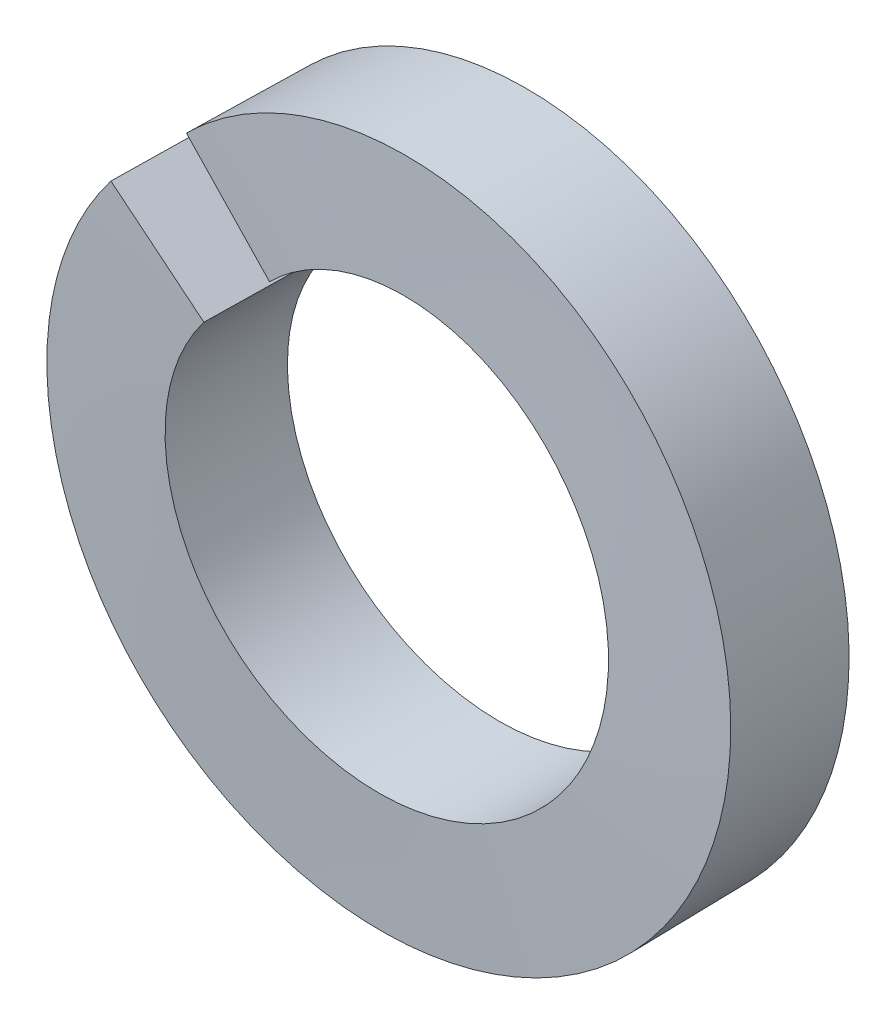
ISO-10303-21;
HEADER;
FILE_DESCRIPTION(('STEP AP214'),'2;1');
FILE_NAME('part.step','',(''),(''),'','','');
FILE_SCHEMA(('AUTOMOTIVE_DESIGN { 1 0 10303 214 1 1 1 1 }'));
ENDSEC;
DATA;
#1=APPLICATION_CONTEXT('core data for automotive mechanical design processes');
#2=APPLICATION_PROTOCOL_DEFINITION('international standard','automotive_design',2000,#1);
#3=PRODUCT_CONTEXT('',#1,'mechanical');
#4=PRODUCT('Part','Part','',(#3));
#5=PRODUCT_RELATED_PRODUCT_CATEGORY('part','',(#4));
#6=PRODUCT_DEFINITION_FORMATION('','',#4);
#7=PRODUCT_DEFINITION_CONTEXT('part definition',#1,'design');
#8=PRODUCT_DEFINITION('design','',#6,#7);
#9=PRODUCT_DEFINITION_SHAPE('','',#8);
#10=(LENGTH_UNIT() NAMED_UNIT(*) SI_UNIT(.MILLI.,.METRE.));
#11=(NAMED_UNIT(*) PLANE_ANGLE_UNIT() SI_UNIT($,.RADIAN.));
#12=(NAMED_UNIT(*) SI_UNIT($,.STERADIAN.) SOLID_ANGLE_UNIT());
#13=UNCERTAINTY_MEASURE_WITH_UNIT(LENGTH_MEASURE(1.E-05),#10,'distance_accuracy_value','');
#14=(GEOMETRIC_REPRESENTATION_CONTEXT(3) GLOBAL_UNCERTAINTY_ASSIGNED_CONTEXT((#13)) GLOBAL_UNIT_ASSIGNED_CONTEXT((#10,
#11,#12)) REPRESENTATION_CONTEXT('',''));
#15=CARTESIAN_POINT('',(0.,0.,0.));
#16=DIRECTION('',(0.,0.,1.));
#17=DIRECTION('',(1.,0.,0.));
#18=AXIS2_PLACEMENT_3D('',#15,#16,#17);
#19=CARTESIAN_POINT('',(-5.41104515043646,4.19874126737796,0.967793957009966));
#20=DIRECTION('',(0.612489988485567,0.789617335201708,0.036884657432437));
#21=DIRECTION('',(-0.790155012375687,0.612907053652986,0.));
#22=AXIS2_PLACEMENT_3D('',#19,#20,#21);
#23=PLANE('',#22);
#24=DIRECTION('',(0.789667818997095,-0.613308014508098,0.0166737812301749));
#25=VECTOR('',#24,1.);
#26=CARTESIAN_POINT('',(-5.41104515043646,4.19874126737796,0.967793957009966));
#27=LINE('',#26,#25);
#28=CARTESIAN_POINT('',(-5.41104515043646,4.19874126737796,0.967793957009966));
#29=VERTEX_POINT('',#28);
#30=CARTESIAN_POINT('',(-3.43687560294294,2.66547123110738,1.00947841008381));
#31=VERTEX_POINT('',#30);
#32=EDGE_CURVE('E75',#29,#31,#27,.T.);
#33=ORIENTED_EDGE('',*,*,#32,.T.);
#34=DIRECTION('',(0.0357875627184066,0.018914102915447,-0.999180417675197));
#35=VECTOR('',#34,1.);
#36=CARTESIAN_POINT('',(-3.43687560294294,2.66547123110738,1.00947841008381));
#37=LINE('',#36,#35);
#38=CARTESIAN_POINT('',(-3.34740669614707,2.71275648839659,-1.48847263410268));
#39=VERTEX_POINT('',#38);
#40=EDGE_CURVE('E81',#31,#39,#37,.T.);
#41=ORIENTED_EDGE('',*,*,#40,.T.);
#42=DIRECTION('',(-0.789667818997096,0.613308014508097,-0.0166737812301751));
#43=VECTOR('',#42,1.);
#44=CARTESIAN_POINT('',(-5.32157624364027,4.24602652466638,-1.53015708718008));
#45=LINE('',#44,#43);
#46=CARTESIAN_POINT('',(-5.32157624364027,4.24602652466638,-1.53015708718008));
#47=VERTEX_POINT('',#46);
#48=EDGE_CURVE('E67',#39,#47,#45,.T.);
#49=ORIENTED_EDGE('',*,*,#48,.T.);
#50=DIRECTION('',(-0.0357875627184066,-0.0189141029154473,0.999180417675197));
#51=VECTOR('',#50,1.);
#52=CARTESIAN_POINT('',(-5.41104515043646,4.19874126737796,0.967793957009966));
#53=LINE('',#52,#51);
#54=EDGE_CURVE('E63',#47,#29,#53,.T.);
#55=ORIENTED_EDGE('',*,*,#54,.T.);
#56=EDGE_LOOP('',(#33,#41,#49,#55));
#57=FACE_BOUND('',#56,.T.);
#58=ADVANCED_FACE('F16',(#57),#23,.T.);
#59=CARTESIAN_POINT('',(-4.84213562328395,4.84381672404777,-0.0322060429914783));
#60=DIRECTION('',(0.706625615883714,0.706625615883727,0.0368846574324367));
#61=DIRECTION('',(-0.707106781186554,0.707106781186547,0.));
#62=AXIS2_PLACEMENT_3D('',#59,#60,#61);
#63=PLANE('',#62);
#64=CARTESIAN_POINT('',(-4.84211494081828,4.84383739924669,-0.0334835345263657));
#65=CARTESIAN_POINT('',(-3.07568955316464,3.07522105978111,0.00820091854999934));
#66=(BOUNDED_CURVE() B_SPLINE_CURVE(1,(#64,#65),.UNSPECIFIED.,.F.,
.F.) B_SPLINE_CURVE_WITH_KNOTS((2,2),(0.,1.),
.UNSPECIFIED.) CURVE() GEOMETRIC_REPRESENTATION_ITEM() RATIONAL_B_SPLINE_CURVE((0.970945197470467,0.970945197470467)) REPRESENTATION_ITEM(''));
#67=CARTESIAN_POINT('',(-4.84212456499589,4.84383410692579,-0.032856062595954));
#68=VERTEX_POINT('',#67);
#69=CARTESIAN_POINT('',(-3.07569266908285,3.07522427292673,0.00882854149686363));
#70=VERTEX_POINT('',#69);
#71=EDGE_CURVE('E53',#68,#70,#66,.T.);
#72=ORIENTED_EDGE('',*,*,#71,.F.);
#73=CARTESIAN_POINT('',(-4.74741180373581,4.87954876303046,-2.53143415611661));
#74=CARTESIAN_POINT('',(-4.8421018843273,4.84385045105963,-0.0334831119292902));
#75=(BOUNDED_CURVE() B_SPLINE_CURVE(1,(#73,#74),.UNSPECIFIED.,.F.,
.F.) B_SPLINE_CURVE_WITH_KNOTS((2,2),(0.,1.),
.UNSPECIFIED.) CURVE() GEOMETRIC_REPRESENTATION_ITEM() RATIONAL_B_SPLINE_CURVE((0.970944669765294,0.970944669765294)) REPRESENTATION_ITEM(''));
#76=CARTESIAN_POINT('',(-4.7474286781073,4.87953836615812,-2.53080696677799));
#77=VERTEX_POINT('',#76);
#78=EDGE_CURVE('E11',#77,#68,#75,.T.);
#79=ORIENTED_EDGE('',*,*,#78,.F.);
#80=CARTESIAN_POINT('',(-2.98097962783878,3.11093873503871,-2.4897491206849));
#81=CARTESIAN_POINT('',(-4.74739367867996,4.87956639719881,-2.53143357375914));
#82=(BOUNDED_CURVE() B_SPLINE_CURVE(1,(#80,#81),.UNSPECIFIED.,.F.,
.F.) B_SPLINE_CURVE_WITH_KNOTS((2,2),(0.,1.),
.UNSPECIFIED.) CURVE() GEOMETRIC_REPRESENTATION_ITEM() RATIONAL_B_SPLINE_CURVE((0.970943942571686,0.970943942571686)) REPRESENTATION_ITEM(''));
#83=CARTESIAN_POINT('',(-2.98099907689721,3.11092800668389,-2.48915050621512));
#84=VERTEX_POINT('',#83);
#85=EDGE_CURVE('E39',#84,#77,#82,.T.);
#86=ORIENTED_EDGE('',*,*,#85,.F.);
#87=CARTESIAN_POINT('',(-3.0756693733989,3.07524124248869,0.00820194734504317));
#88=CARTESIAN_POINT('',(-2.98097915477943,3.11093918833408,-2.48974909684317));
#89=(BOUNDED_CURVE() B_SPLINE_CURVE(1,(#87,#88),.UNSPECIFIED.,.F.,
.F.) B_SPLINE_CURVE_WITH_KNOTS((2,2),(0.,1.),
.UNSPECIFIED.) CURVE() GEOMETRIC_REPRESENTATION_ITEM() RATIONAL_B_SPLINE_CURVE((0.970943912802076,0.970943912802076)) REPRESENTATION_ITEM(''));
#90=EDGE_CURVE('E132',#70,#84,#89,.T.);
#91=ORIENTED_EDGE('',*,*,#90,.F.);
#92=EDGE_LOOP('',(#72,#79,#86,#91));
#93=FACE_BOUND('',#92,.T.);
#94=ADVANCED_FACE('F104',(#93),#63,.F.);
#95=CARTESIAN_POINT('',(-5.41104515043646,4.19874126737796,0.967793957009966));
#96=CARTESIAN_POINT('',(-7.83518955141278,1.07467289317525,0.882759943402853));
#97=CARTESIAN_POINT('',(-6.3417391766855,-2.58673192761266,0.797725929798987));
#98=CARTESIAN_POINT('',(-4.84828880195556,-6.24813674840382,0.712691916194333));
#99=CARTESIAN_POINT('',(-0.930694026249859,-6.78547319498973,0.62765790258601));
#100=CARTESIAN_POINT('',(2.98690074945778,-7.32280964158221,0.542623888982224));
#101=CARTESIAN_POINT('',(5.41104515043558,-4.19874126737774,0.45758987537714));
#102=CARTESIAN_POINT('',(7.83518955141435,-1.07467289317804,0.372555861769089));
#103=CARTESIAN_POINT('',(6.34173917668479,2.58673192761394,0.287521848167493));
#104=CARTESIAN_POINT('',(4.84828880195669,6.24813674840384,0.202487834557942));
#105=CARTESIAN_POINT('',(0.930694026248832,6.78547319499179,0.117453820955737));
#106=CARTESIAN_POINT('',(-2.98690074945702,7.32280964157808,0.0324198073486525));
#107=CARTESIAN_POINT('',(-5.41104515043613,4.1987412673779,-0.052614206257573));
#108=CARTESIAN_POINT('',(-3.43687560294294,2.66547123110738,1.00947841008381));
#109=CARTESIAN_POINT('',(-4.97578613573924,0.681190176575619,0.924444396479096));
#110=CARTESIAN_POINT('',(-4.02680360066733,-1.64368596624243,0.839410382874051));
#111=CARTESIAN_POINT('',(-3.07782106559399,-3.96856210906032,0.754376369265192));
#112=CARTESIAN_POINT('',(-0.589927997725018,-4.30915719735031,0.66934235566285));
#113=CARTESIAN_POINT('',(1.89796507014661,-4.64975228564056,0.584308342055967));
#114=CARTESIAN_POINT('',(3.43687560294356,-2.66547123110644,0.499274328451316));
#115=CARTESIAN_POINT('',(4.97578613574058,-0.681190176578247,0.414240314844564));
#116=CARTESIAN_POINT('',(4.02680360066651,1.64368596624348,0.32920630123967));
#117=CARTESIAN_POINT('',(3.07782106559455,3.96856210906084,0.244172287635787));
#118=CARTESIAN_POINT('',(0.589927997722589,4.30915719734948,0.159138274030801));
#119=CARTESIAN_POINT('',(-1.89796507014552,4.64975228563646,0.0741042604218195));
#120=CARTESIAN_POINT('',(-3.43687560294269,2.66547123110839,-0.0109297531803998));
#121=(BOUNDED_SURFACE() B_SPLINE_SURFACE(1,2,((#95,#96,#97,#98,#99,#100,#101,#102,#103,#104,
#105,#106,#107),(#108,#109,#110,#111,#112,#113,#114,#115,#116,#117,#118,#119,#120)),
.UNSPECIFIED.,.F.,.F.,.F.) B_SPLINE_SURFACE_WITH_KNOTS((2,2),(3,2,2,2,2,2,3),(0.,1.),(0.,
0.166666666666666,0.333333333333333,0.5,0.666666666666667,0.833333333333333,1.),
.UNSPECIFIED.) GEOMETRIC_REPRESENTATION_ITEM() RATIONAL_B_SPLINE_SURFACE(((1.,0.866025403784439,
1.,0.866025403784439,1.,0.866025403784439,1.,0.866025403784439,1.,0.866025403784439,1.,
0.866025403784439,1.),(1.,0.866025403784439,1.,0.866025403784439,1.,0.866025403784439,1.,
0.866025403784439,1.,0.866025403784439,1.,0.866025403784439,1.))) REPRESENTATION_ITEM('') SURFACE());
#122=CARTESIAN_POINT('',(-3.43687560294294,2.66547123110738,1.00947841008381));
#123=CARTESIAN_POINT('',(-4.97578613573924,0.681190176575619,0.924444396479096));
#124=CARTESIAN_POINT('',(-4.02680360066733,-1.64368596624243,0.839410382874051));
#125=CARTESIAN_POINT('',(-3.07782106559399,-3.96856210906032,0.754376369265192));
#126=CARTESIAN_POINT('',(-0.589927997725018,-4.30915719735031,0.66934235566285));
#127=CARTESIAN_POINT('',(1.89796507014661,-4.64975228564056,0.584308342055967));
#128=CARTESIAN_POINT('',(3.43687560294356,-2.66547123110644,0.499274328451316));
#129=CARTESIAN_POINT('',(4.97578613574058,-0.681190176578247,0.414240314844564));
#130=CARTESIAN_POINT('',(4.02680360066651,1.64368596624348,0.32920630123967));
#131=CARTESIAN_POINT('',(3.07782106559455,3.96856210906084,0.244172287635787));
#132=CARTESIAN_POINT('',(0.589927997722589,4.30915719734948,0.159138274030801));
#133=CARTESIAN_POINT('',(-1.89796507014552,4.64975228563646,0.0741042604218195));
#134=CARTESIAN_POINT('',(-3.43687560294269,2.66547123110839,-0.0109297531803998));
#135=(BOUNDED_CURVE() B_SPLINE_CURVE(2,(#122,#123,#124,#125,#126,#127,#128,#129,#130,#131,#132,
#133,#134),.UNSPECIFIED.,.F.,.F.) B_SPLINE_CURVE_WITH_KNOTS((3,2,2,2,2,2,3),(0.,
0.166666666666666,0.333333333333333,0.5,0.666666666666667,0.833333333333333,1.),
.UNSPECIFIED.) CURVE() GEOMETRIC_REPRESENTATION_ITEM() RATIONAL_B_SPLINE_CURVE((1.,
0.866025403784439,1.,0.866025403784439,1.,0.866025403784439,1.,0.866025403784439,1.,
0.866025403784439,1.,0.866025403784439,1.)) REPRESENTATION_ITEM(''));
#136=EDGE_CURVE('E79',#31,#70,#135,.T.);
#137=CARTESIAN_POINT('',(-5.41104515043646,4.19874126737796,0.967793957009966));
#138=CARTESIAN_POINT('',(-7.83518955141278,1.07467289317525,0.882759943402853));
#139=CARTESIAN_POINT('',(-6.3417391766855,-2.58673192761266,0.797725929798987));
#140=CARTESIAN_POINT('',(-4.84828880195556,-6.24813674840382,0.712691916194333));
#141=CARTESIAN_POINT('',(-0.930694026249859,-6.78547319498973,0.62765790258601));
#142=CARTESIAN_POINT('',(2.98690074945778,-7.32280964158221,0.542623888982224));
#143=CARTESIAN_POINT('',(5.41104515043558,-4.19874126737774,0.45758987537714));
#144=CARTESIAN_POINT('',(7.83518955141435,-1.07467289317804,0.372555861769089));
#145=CARTESIAN_POINT('',(6.34173917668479,2.58673192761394,0.287521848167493));
#146=CARTESIAN_POINT('',(4.84828880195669,6.24813674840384,0.202487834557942));
#147=CARTESIAN_POINT('',(0.930694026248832,6.78547319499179,0.117453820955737));
#148=CARTESIAN_POINT('',(-2.98690074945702,7.32280964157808,0.0324198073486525));
#149=CARTESIAN_POINT('',(-5.41104515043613,4.1987412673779,-0.052614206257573));
#150=(BOUNDED_CURVE() B_SPLINE_CURVE(2,(#137,#138,#139,#140,#141,#142,#143,#144,#145,#146,#147,
#148,#149),.UNSPECIFIED.,.F.,.F.) B_SPLINE_CURVE_WITH_KNOTS((3,2,2,2,2,2,3),(0.,
0.166666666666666,0.333333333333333,0.5,0.666666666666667,0.833333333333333,1.),
.UNSPECIFIED.) CURVE() GEOMETRIC_REPRESENTATION_ITEM() RATIONAL_B_SPLINE_CURVE((1.,
0.866025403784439,1.,0.866025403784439,1.,0.866025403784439,1.,0.866025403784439,1.,
0.866025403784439,1.,0.866025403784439,1.)) REPRESENTATION_ITEM(''));
#151=EDGE_CURVE('E77',#29,#68,#150,.T.);
#152=ORIENTED_EDGE('',*,*,#136,.F.);
#153=ORIENTED_EDGE('',*,*,#32,.F.);
#154=ORIENTED_EDGE('',*,*,#151,.T.);
#155=ORIENTED_EDGE('',*,*,#71,.T.);
#156=EDGE_LOOP('',(#152,#153,#154,#155));
#157=FACE_BOUND('',#156,.T.);
#158=ADVANCED_FACE('F76',(#157),#121,.F.);
#159=CARTESIAN_POINT('',(-3.43687560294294,2.66547123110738,1.00947841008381));
#160=CARTESIAN_POINT('',(-4.97578613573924,0.681190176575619,0.924444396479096));
#161=CARTESIAN_POINT('',(-4.02680360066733,-1.64368596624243,0.839410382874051));
#162=CARTESIAN_POINT('',(-3.07782106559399,-3.96856210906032,0.754376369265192));
#163=CARTESIAN_POINT('',(-0.589927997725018,-4.30915719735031,0.66934235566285));
#164=CARTESIAN_POINT('',(1.89796507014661,-4.64975228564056,0.584308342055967));
#165=CARTESIAN_POINT('',(3.43687560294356,-2.66547123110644,0.499274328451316));
#166=CARTESIAN_POINT('',(4.97578613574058,-0.681190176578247,0.414240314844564));
#167=CARTESIAN_POINT('',(4.02680360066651,1.64368596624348,0.32920630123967));
#168=CARTESIAN_POINT('',(3.07782106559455,3.96856210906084,0.244172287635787));
#169=CARTESIAN_POINT('',(0.589927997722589,4.30915719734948,0.159138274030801));
#170=CARTESIAN_POINT('',(-1.89796507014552,4.64975228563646,0.0741042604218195));
#171=CARTESIAN_POINT('',(-3.43687560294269,2.66547123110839,-0.0109297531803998));
#172=CARTESIAN_POINT('',(-3.34740669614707,2.71275648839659,-1.48847263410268));
#173=CARTESIAN_POINT('',(-4.91361738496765,0.78013033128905,-1.57350664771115));
#174=CARTESIAN_POINT('',(-4.02301938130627,-1.54256099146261,-1.65854066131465));
#175=CARTESIAN_POINT('',(-3.13242137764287,-3.86525231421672,-1.74357467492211));
#176=CARTESIAN_POINT('',(-0.675612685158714,-4.2553174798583,-1.82860868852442));
#177=CARTESIAN_POINT('',(1.78119600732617,-4.64538264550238,-1.91364270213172));
#178=CARTESIAN_POINT('',(3.3474066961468,-2.71275648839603,-1.99867671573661));
#179=CARTESIAN_POINT('',(4.91361738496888,-0.780130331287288,-2.08371072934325));
#180=CARTESIAN_POINT('',(4.02301938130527,1.54256099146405,-2.16874474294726));
#181=CARTESIAN_POINT('',(3.1324213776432,3.86525231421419,-2.25377875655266));
#182=CARTESIAN_POINT('',(0.675612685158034,4.25531747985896,-2.33881277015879));
#183=CARTESIAN_POINT('',(-1.78119600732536,4.64538264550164,-2.42384678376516));
#184=CARTESIAN_POINT('',(-3.34740669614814,2.71275648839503,-2.50888079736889));
#185=(BOUNDED_SURFACE() B_SPLINE_SURFACE(1,2,((#159,#160,#161,#162,#163,#164,#165,#166,#167,
#168,#169,#170,#171),(#172,#173,#174,#175,#176,#177,#178,#179,#180,#181,#182,#183,#184)),
.UNSPECIFIED.,.F.,.F.,.F.) B_SPLINE_SURFACE_WITH_KNOTS((2,2),(3,2,2,2,2,2,3),(0.,1.),(0.,
0.166666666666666,0.333333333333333,0.5,0.666666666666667,0.833333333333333,1.),
.UNSPECIFIED.) GEOMETRIC_REPRESENTATION_ITEM() RATIONAL_B_SPLINE_SURFACE(((1.,0.866025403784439,
1.,0.866025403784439,1.,0.866025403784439,1.,0.866025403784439,1.,0.866025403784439,1.,
0.866025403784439,1.),(1.,0.866025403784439,1.,0.866025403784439,1.,0.866025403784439,1.,
0.866025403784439,1.,0.866025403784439,1.,0.866025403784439,1.))) REPRESENTATION_ITEM('') SURFACE());
#186=CARTESIAN_POINT('',(-3.34740669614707,2.71275648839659,-1.48847263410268));
#187=CARTESIAN_POINT('',(-4.91361738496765,0.78013033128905,-1.57350664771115));
#188=CARTESIAN_POINT('',(-4.02301938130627,-1.54256099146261,-1.65854066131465));
#189=CARTESIAN_POINT('',(-3.13242137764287,-3.86525231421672,-1.74357467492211));
#190=CARTESIAN_POINT('',(-0.675612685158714,-4.2553174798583,-1.82860868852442));
#191=CARTESIAN_POINT('',(1.78119600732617,-4.64538264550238,-1.91364270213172));
#192=CARTESIAN_POINT('',(3.3474066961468,-2.71275648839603,-1.99867671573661));
#193=CARTESIAN_POINT('',(4.91361738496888,-0.780130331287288,-2.08371072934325));
#194=CARTESIAN_POINT('',(4.02301938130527,1.54256099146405,-2.16874474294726));
#195=CARTESIAN_POINT('',(3.1324213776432,3.86525231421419,-2.25377875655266));
#196=CARTESIAN_POINT('',(0.675612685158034,4.25531747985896,-2.33881277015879));
#197=CARTESIAN_POINT('',(-1.78119600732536,4.64538264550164,-2.42384678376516));
#198=CARTESIAN_POINT('',(-3.34740669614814,2.71275648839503,-2.50888079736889));
#199=(BOUNDED_CURVE() B_SPLINE_CURVE(2,(#186,#187,#188,#189,#190,#191,#192,#193,#194,#195,#196,
#197,#198),.UNSPECIFIED.,.F.,.F.) B_SPLINE_CURVE_WITH_KNOTS((3,2,2,2,2,2,3),(0.,
0.166666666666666,0.333333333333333,0.5,0.666666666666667,0.833333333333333,1.),
.UNSPECIFIED.) CURVE() GEOMETRIC_REPRESENTATION_ITEM() RATIONAL_B_SPLINE_CURVE((1.,
0.866025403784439,1.,0.866025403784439,1.,0.866025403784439,1.,0.866025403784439,1.,
0.866025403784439,1.,0.866025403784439,1.)) REPRESENTATION_ITEM(''));
#200=EDGE_CURVE('E136',#39,#84,#199,.T.);
#201=ORIENTED_EDGE('',*,*,#200,.F.);
#202=ORIENTED_EDGE('',*,*,#40,.F.);
#203=ORIENTED_EDGE('',*,*,#136,.T.);
#204=ORIENTED_EDGE('',*,*,#90,.T.);
#205=EDGE_LOOP('',(#201,#202,#203,#204));
#206=FACE_BOUND('',#205,.T.);
#207=ADVANCED_FACE('F137',(#206),#185,.F.);
#208=CARTESIAN_POINT('',(-3.34740669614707,2.71275648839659,-1.48847263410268));
#209=CARTESIAN_POINT('',(-4.91361738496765,0.78013033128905,-1.57350664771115));
#210=CARTESIAN_POINT('',(-4.02301938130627,-1.54256099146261,-1.65854066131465));
#211=CARTESIAN_POINT('',(-3.13242137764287,-3.86525231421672,-1.74357467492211));
#212=CARTESIAN_POINT('',(-0.675612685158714,-4.2553174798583,-1.82860868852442));
#213=CARTESIAN_POINT('',(1.78119600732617,-4.64538264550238,-1.91364270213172));
#214=CARTESIAN_POINT('',(3.3474066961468,-2.71275648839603,-1.99867671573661));
#215=CARTESIAN_POINT('',(4.91361738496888,-0.780130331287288,-2.08371072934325));
#216=CARTESIAN_POINT('',(4.02301938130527,1.54256099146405,-2.16874474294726));
#217=CARTESIAN_POINT('',(3.1324213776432,3.86525231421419,-2.25377875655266));
#218=CARTESIAN_POINT('',(0.675612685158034,4.25531747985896,-2.33881277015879));
#219=CARTESIAN_POINT('',(-1.78119600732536,4.64538264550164,-2.42384678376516));
#220=CARTESIAN_POINT('',(-3.34740669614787,2.71275648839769,-2.50888079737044));
#221=CARTESIAN_POINT('',(-5.32157624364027,4.24602652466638,-1.53015708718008));
#222=CARTESIAN_POINT('',(-7.77302080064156,1.17361304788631,-1.61519110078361));
#223=CARTESIAN_POINT('',(-6.33795495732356,-2.48560695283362,-1.70022511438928));
#224=CARTESIAN_POINT('',(-4.90288911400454,-6.14482695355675,-1.78525912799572));
#225=CARTESIAN_POINT('',(-1.0163787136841,-6.73163347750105,-1.8702931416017));
#226=CARTESIAN_POINT('',(2.87013168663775,-7.31844000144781,-1.95532715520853));
#227=CARTESIAN_POINT('',(5.32157624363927,-4.24602652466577,-2.04036116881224));
#228=CARTESIAN_POINT('',(7.77302080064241,-1.17361304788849,-2.12539518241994));
#229=CARTESIAN_POINT('',(6.33795495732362,2.4856069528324,-2.21042919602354));
#230=CARTESIAN_POINT('',(4.90288911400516,6.1448269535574,-2.29546320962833));
#231=CARTESIAN_POINT('',(1.01637871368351,6.73163347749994,-2.38049722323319));
#232=CARTESIAN_POINT('',(-2.87013168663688,7.31844000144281,-2.46553123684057));
#233=CARTESIAN_POINT('',(-5.32157624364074,4.24602652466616,-2.55056525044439));
#234=(BOUNDED_SURFACE() B_SPLINE_SURFACE(1,2,((#208,#209,#210,#211,#212,#213,#214,#215,#216,
#217,#218,#219,#220),(#221,#222,#223,#224,#225,#226,#227,#228,#229,#230,#231,#232,#233)),
.UNSPECIFIED.,.F.,.F.,.F.) B_SPLINE_SURFACE_WITH_KNOTS((2,2),(3,2,2,2,2,2,3),(0.,1.),(0.,
0.166666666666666,0.333333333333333,0.5,0.666666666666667,0.833333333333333,1.),
.UNSPECIFIED.) GEOMETRIC_REPRESENTATION_ITEM() RATIONAL_B_SPLINE_SURFACE(((1.,0.866025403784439,
1.,0.866025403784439,1.,0.866025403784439,1.,0.866025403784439,1.,0.866025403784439,1.,
0.866025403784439,1.),(1.,0.866025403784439,1.,0.866025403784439,1.,0.866025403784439,1.,
0.866025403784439,1.,0.866025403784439,1.,0.866025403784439,1.))) REPRESENTATION_ITEM('') SURFACE());
#235=CARTESIAN_POINT('',(-5.32157624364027,4.24602652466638,-1.53015708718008));
#236=CARTESIAN_POINT('',(-7.77302080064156,1.17361304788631,-1.61519110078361));
#237=CARTESIAN_POINT('',(-6.33795495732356,-2.48560695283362,-1.70022511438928));
#238=CARTESIAN_POINT('',(-4.90288911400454,-6.14482695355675,-1.78525912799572));
#239=CARTESIAN_POINT('',(-1.0163787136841,-6.73163347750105,-1.8702931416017));
#240=CARTESIAN_POINT('',(2.87013168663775,-7.31844000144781,-1.95532715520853));
#241=CARTESIAN_POINT('',(5.32157624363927,-4.24602652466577,-2.04036116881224));
#242=CARTESIAN_POINT('',(7.77302080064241,-1.17361304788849,-2.12539518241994));
#243=CARTESIAN_POINT('',(6.33795495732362,2.4856069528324,-2.21042919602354));
#244=CARTESIAN_POINT('',(4.90288911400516,6.1448269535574,-2.29546320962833));
#245=CARTESIAN_POINT('',(1.01637871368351,6.73163347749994,-2.38049722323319));
#246=CARTESIAN_POINT('',(-2.87013168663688,7.31844000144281,-2.46553123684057));
#247=CARTESIAN_POINT('',(-5.32157624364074,4.24602652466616,-2.55056525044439));
#248=(BOUNDED_CURVE() B_SPLINE_CURVE(2,(#235,#236,#237,#238,#239,#240,#241,#242,#243,#244,#245,
#246,#247),.UNSPECIFIED.,.F.,.F.) B_SPLINE_CURVE_WITH_KNOTS((3,2,2,2,2,2,3),(0.,
0.166666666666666,0.333333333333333,0.5,0.666666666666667,0.833333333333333,1.),
.UNSPECIFIED.) CURVE() GEOMETRIC_REPRESENTATION_ITEM() RATIONAL_B_SPLINE_CURVE((1.,
0.866025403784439,1.,0.866025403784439,1.,0.866025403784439,1.,0.866025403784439,1.,
0.866025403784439,1.,0.866025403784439,1.)) REPRESENTATION_ITEM(''));
#249=EDGE_CURVE('E31',#47,#77,#248,.T.);
#250=ORIENTED_EDGE('',*,*,#249,.F.);
#251=ORIENTED_EDGE('',*,*,#48,.F.);
#252=ORIENTED_EDGE('',*,*,#200,.T.);
#253=ORIENTED_EDGE('',*,*,#85,.T.);
#254=EDGE_LOOP('',(#250,#251,#252,#253));
#255=FACE_BOUND('',#254,.T.);
#256=ADVANCED_FACE('F166',(#255),#234,.F.);
#257=CARTESIAN_POINT('',(-5.32157624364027,4.24602652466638,-1.53015708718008));
#258=CARTESIAN_POINT('',(-7.77302080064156,1.17361304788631,-1.61519110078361));
#259=CARTESIAN_POINT('',(-6.33795495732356,-2.48560695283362,-1.70022511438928));
#260=CARTESIAN_POINT('',(-4.90288911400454,-6.14482695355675,-1.78525912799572));
#261=CARTESIAN_POINT('',(-1.0163787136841,-6.73163347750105,-1.8702931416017));
#262=CARTESIAN_POINT('',(2.87013168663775,-7.31844000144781,-1.95532715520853));
#263=CARTESIAN_POINT('',(5.32157624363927,-4.24602652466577,-2.04036116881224));
#264=CARTESIAN_POINT('',(7.77302080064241,-1.17361304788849,-2.12539518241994));
#265=CARTESIAN_POINT('',(6.33795495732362,2.4856069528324,-2.21042919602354));
#266=CARTESIAN_POINT('',(4.90288911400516,6.1448269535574,-2.29546320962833));
#267=CARTESIAN_POINT('',(1.01637871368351,6.73163347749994,-2.38049722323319));
#268=CARTESIAN_POINT('',(-2.87013168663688,7.31844000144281,-2.46553123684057));
#269=CARTESIAN_POINT('',(-5.32157624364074,4.24602652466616,-2.55056525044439));
#270=CARTESIAN_POINT('',(-5.41104515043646,4.19874126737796,0.967793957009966));
#271=CARTESIAN_POINT('',(-7.83518955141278,1.07467289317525,0.882759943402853));
#272=CARTESIAN_POINT('',(-6.3417391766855,-2.58673192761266,0.797725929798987));
#273=CARTESIAN_POINT('',(-4.84828880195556,-6.24813674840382,0.712691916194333));
#274=CARTESIAN_POINT('',(-0.930694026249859,-6.78547319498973,0.62765790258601));
#275=CARTESIAN_POINT('',(2.98690074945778,-7.32280964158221,0.542623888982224));
#276=CARTESIAN_POINT('',(5.41104515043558,-4.19874126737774,0.45758987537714));
#277=CARTESIAN_POINT('',(7.83518955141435,-1.07467289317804,0.372555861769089));
#278=CARTESIAN_POINT('',(6.34173917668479,2.58673192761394,0.287521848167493));
#279=CARTESIAN_POINT('',(4.84828880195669,6.24813674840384,0.202487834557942));
#280=CARTESIAN_POINT('',(0.930694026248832,6.78547319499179,0.117453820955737));
#281=CARTESIAN_POINT('',(-2.98690074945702,7.32280964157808,0.0324198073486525));
#282=CARTESIAN_POINT('',(-5.41104515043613,4.1987412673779,-0.052614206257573));
#283=(BOUNDED_SURFACE() B_SPLINE_SURFACE(1,2,((#257,#258,#259,#260,#261,#262,#263,#264,#265,
#266,#267,#268,#269),(#270,#271,#272,#273,#274,#275,#276,#277,#278,#279,#280,#281,#282)),
.UNSPECIFIED.,.F.,.F.,.F.) B_SPLINE_SURFACE_WITH_KNOTS((2,2),(3,2,2,2,2,2,3),(0.,1.),(0.,
0.166666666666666,0.333333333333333,0.5,0.666666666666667,0.833333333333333,1.),
.UNSPECIFIED.) GEOMETRIC_REPRESENTATION_ITEM() RATIONAL_B_SPLINE_SURFACE(((1.,0.866025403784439,
1.,0.866025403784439,1.,0.866025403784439,1.,0.866025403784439,1.,0.866025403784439,1.,
0.866025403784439,1.),(1.,0.866025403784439,1.,0.866025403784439,1.,0.866025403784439,1.,
0.866025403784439,1.,0.866025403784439,1.,0.866025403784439,1.))) REPRESENTATION_ITEM('') SURFACE());
#284=ORIENTED_EDGE('',*,*,#78,.T.);
#285=ORIENTED_EDGE('',*,*,#151,.F.);
#286=ORIENTED_EDGE('',*,*,#54,.F.);
#287=ORIENTED_EDGE('',*,*,#249,.T.);
#288=EDGE_LOOP('',(#284,#285,#286,#287));
#289=FACE_BOUND('',#288,.T.);
#290=ADVANCED_FACE('F18',(#289),#283,.F.);
#291=CLOSED_SHELL('',(#58,#94,#158,#207,#256,#290));
#292=MANIFOLD_SOLID_BREP('B1',#291);
#293=ADVANCED_BREP_SHAPE_REPRESENTATION('',(#18,#292),#14);
#294=SHAPE_DEFINITION_REPRESENTATION(#9,#293);
ENDSEC;
END-ISO-10303-21;
